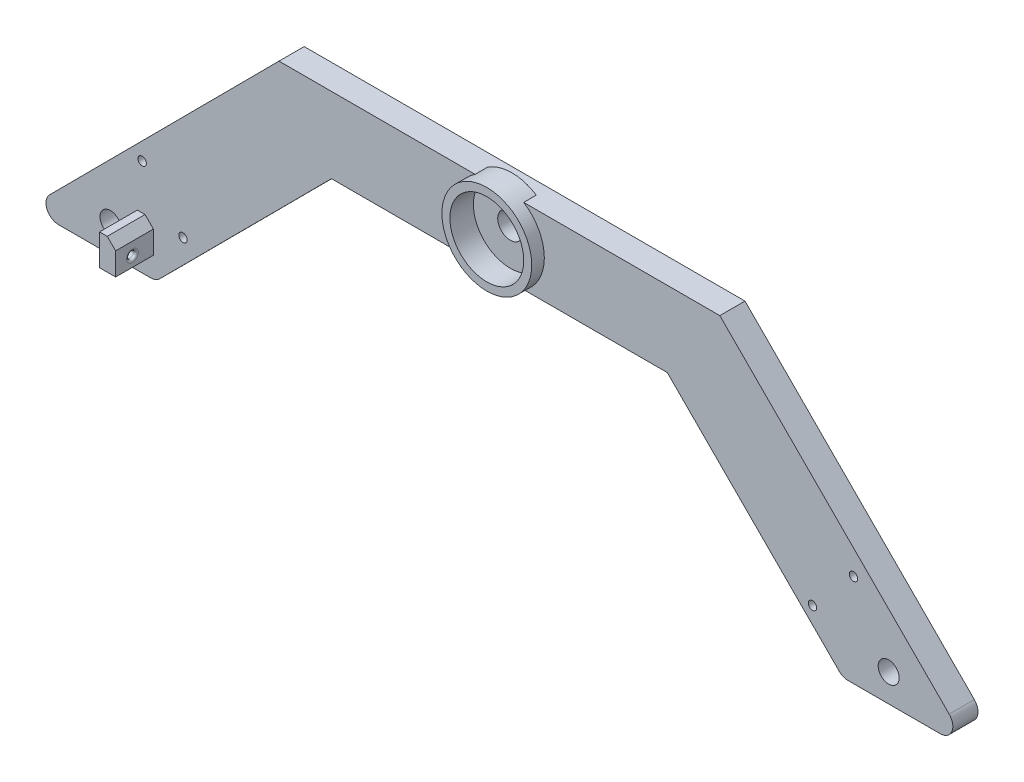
from build123d import *

# Parameters (mm, degrees)
BOSS_EXTRUDE1_DEPTH = 3.81
SKETCH2_R           = 3.175
CUT_EXTRUDE1_DEPTH  = 210.483232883
SKETCH3_R           = 13.589
BOSS_EXTRUDE2_DEPTH = 7.62
SKETCH4_R           = 3.81
CUT_EXTRUDE2_DEPTH  = 11.43
SKETCH5_R           = 11.176
CUT_EXTRUDE3_DEPTH  = 7.112
SKETCH8_W           = 4.859631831
SKETCH8_H           = 9.398
BOSS_EXTRUDE3_DEPTH = 11.43
CHAMFER1_SIZE       = 2.54
SKETCH9_R           = 1.0287
CUT_EXTRUDE4_DEPTH  = 255.153333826
FILLET1_R           = 0.762
SKETCH10_R          = 1.27
CUT_EXTRUDE5_DEPTH  = 17.526


with BuildPart() as part:
    # Sketch1 → Boss-Extrude1 (new, symmetric)
    with BuildSketch(Plane.XY):
        with BuildLine():
            Line((-78.422711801, -70.202411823), (-9.048093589, -0.500134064))
            Line((-9.048093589, -0.500134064), (124.303502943, -0.500134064))
            Line((124.303502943, -0.500134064), (193.678121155, -70.202411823))
            ThreePointArc((193.678121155, -70.202411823), (194.495965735, -74.352303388), (190.977704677, -76.700134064))
            Line((190.977704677, -76.700134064), (163.09108168, -76.700134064))
            ThreePointArc((163.09108168, -76.700134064), (161.628912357, -76.408395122), (160.390665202, -75.577856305))
            Line((160.390665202, -75.577856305), (108.427704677, -23.369472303))
            Line((108.427704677, -23.369472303), (6.827704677, -23.369472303))
            Line((6.827704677, -23.369472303), (-45.135255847, -75.577856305))
            ThreePointArc((-45.135255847, -75.577856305), (-46.373503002, -76.408395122), (-47.835672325, -76.700134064))
            Line((-47.835672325, -76.700134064), (-75.722295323, -76.700134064))
            ThreePointArc((-75.722295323, -76.700134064), (-79.24055638, -74.352303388), (-78.422711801, -70.202411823))
        make_face()
    extrude(amount=BOSS_EXTRUDE1_DEPTH, both=True)

    # Sketch2 → Cut-Extrude1 (cut, through all)
    with BuildSketch(Plane.XY.offset(3.81)):
        with Locations((-60.023724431, -68.318134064)):
            Circle(SKETCH2_R)
        with Locations((175.383820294, -68.318134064)):
            Circle(SKETCH2_R)
    extrude(amount=-CUT_EXTRUDE1_DEPTH, mode=Mode.SUBTRACT)

    # Sketch3 → Boss-Extrude2 (add)
    with BuildSketch(Plane.XY):
        with Locations(Location((57.627704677, -11.930134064, 0), (0, 0, 122.741263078))):
            Circle(SKETCH3_R)
    extrude(amount=BOSS_EXTRUDE2_DEPTH)

    # Sketch4 → Cut-Extrude2 (cut)
    with BuildSketch(Plane.XY.offset(7.62)):
        with Locations((57.627704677, -11.930134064)):
            Circle(SKETCH4_R)
    extrude(amount=-CUT_EXTRUDE2_DEPTH, mode=Mode.SUBTRACT)

    # Sketch5 → Cut-Extrude3 (cut)
    with BuildSketch(Plane.XY.offset(7.62)):
        with Locations((57.627704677, -11.930134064)):
            Circle(SKETCH5_R)
    extrude(amount=-CUT_EXTRUDE3_DEPTH, mode=Mode.SUBTRACT)

    # Sketch8 → Boss-Extrude3 (add)
    with BuildSketch(Plane.XY.offset(3.81)):
        with Locations((-49.465908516, -65.651134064)):
            Rectangle(SKETCH8_W, SKETCH8_H)
    extrude(amount=BOSS_EXTRUDE3_DEPTH)

    # Chamfer1
    chamfer1_edges = [part.edges().sort_by_distance(p)[0] for p in [
        (-47.0360926, -60.952134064, 9.525),
    ]]
    chamfer(chamfer1_edges, length=CHAMFER1_SIZE)

    # Sketch9 → Cut-Extrude4 (cut, through all)
    with BuildSketch(Plane(origin=(-47.0360926, 0, 0), x_dir=(0, 0, -1), z_dir=(1, 0, 0))):
        with Locations((-10.154893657, -67.298754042)):
            Circle(SKETCH9_R)
    extrude(amount=-CUT_EXTRUDE4_DEPTH, mode=Mode.SUBTRACT)

    # Fillet1
    fillet1_edges = [part.edges().sort_by_distance(p)[0] for p in [
        (-47.0360926, -67.298754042, 11.183593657),
    ]]
    fillet(fillet1_edges, radius=FILLET1_R)

    # Sketch10 → Cut-Extrude5 (cut)
    with BuildSketch(Plane(origin=(0, 0, -3.81), x_dir=(-1, 0, 0), z_dir=(0, 0, -1))):
        with Locations((38.0964786, -61.252783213)):
            Circle(SKETCH10_R)
        with Locations((50.438987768, -47.369241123)):
            Circle(SKETCH10_R)
        with Locations((-164.7423325, -48.616373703)):
            Circle(SKETCH10_R)
        with Locations((-152.332770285, -62.432546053)):
            Circle(SKETCH10_R)
    extrude(amount=-CUT_EXTRUDE5_DEPTH, mode=Mode.SUBTRACT)


solid = part.part
